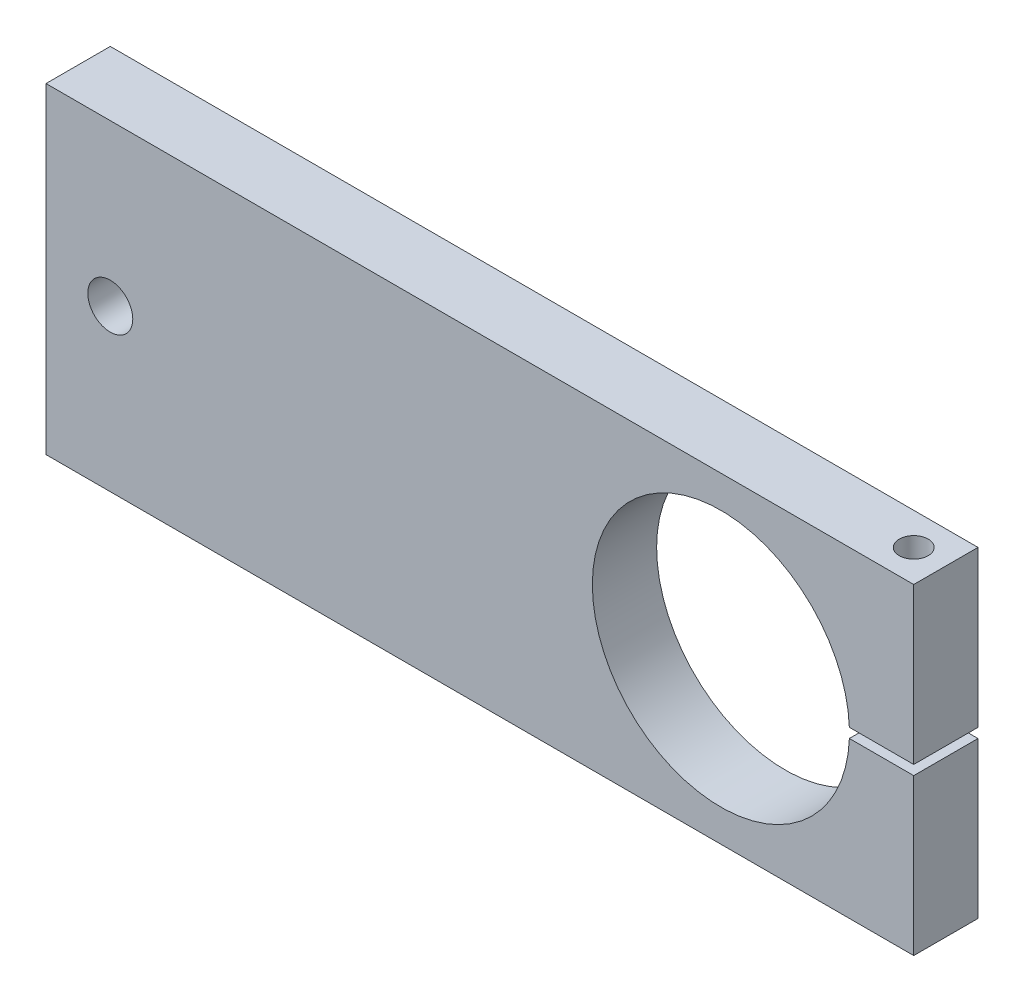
from build123d import *

# Parameters (mm, degrees)
SKETCH_1_R          = 7
EXTRUDE_1_DEPTH     = 20
SKETCH_2_R          = 7
CUT_EXTRUDE_1_DEPTH = 10
CUT_EXTRUDE_2_REACH = 231.347
SKETCH_3_R          = 4.5


with BuildPart() as part:
    # Sketch 1 → Extrude 1 (new body)
    with BuildSketch(Plane.XY):
        with BuildLine():
            Line((-210, 50), (-210, -50))
            Line((-210, -50), (60, -50))
            Line((60, -50), (60, -1.5))
            Line((60, -1.5), (39.971865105, -1.5))
            ThreePointArc((39.971865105, -1.5), (-40, 0), (39.971865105, 1.5))
            Line((39.971865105, 1.5), (60, 1.5))
            Line((60, 1.5), (60, 50))
            Line((60, 50), (-210, 50))
        make_face()
        with Locations((-190, 0)):
            Circle(SKETCH_1_R, mode=Mode.SUBTRACT)
    extrude(amount=EXTRUDE_1_DEPTH)

    # Sketch 2 → Cut-Extrude 1 (cut)
    with BuildSketch(Plane.XZ.offset(50)):
        with Locations(Location((50, 10, 0), (0, 0, 270))):
            Circle(SKETCH_2_R)
    extrude(amount=-CUT_EXTRUDE_1_DEPTH, mode=Mode.SUBTRACT)

    # Cut-Extrude 2: up to this face of the body (flat: up to its plane)
    cut_extrude_2_end = Plane(part.part.faces().sort_by_distance((-75, 50, 10))[0])
    # Sketch 3 → Cut-Extrude 2 (cut, up to the picked face)
    with BuildSketch(Plane.XZ.offset(40), mode=Mode.PRIVATE) as cut_extrude_2_sk1:
        with Locations(Location((50, 10, 0), (0, 0, 270))):
            Circle(SKETCH_3_R)
    cut_extrude_2_tool1 = split(extrude(cut_extrude_2_sk1.sketch, amount=-CUT_EXTRUDE_2_REACH, mode=Mode.PRIVATE), bisect_by=cut_extrude_2_end, keep=Keep.BOTH, mode=Mode.PRIVATE)
    add(cut_extrude_2_tool1.solids().sort_by(Axis((50, -40, 10), (0, 1, 0)))[0], mode=Mode.SUBTRACT)


solid = part.part
